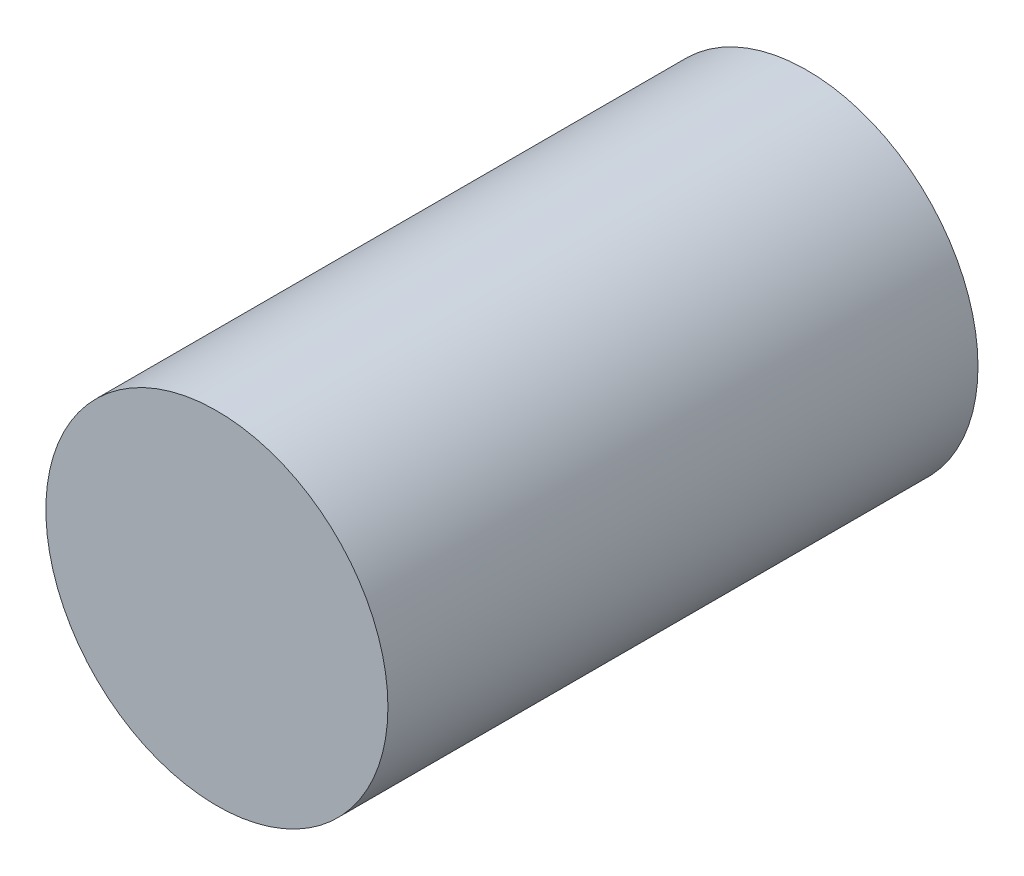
ISO-10303-21;
HEADER;
FILE_DESCRIPTION(('STEP AP214'),'2;1');
FILE_NAME('part.step','',(''),(''),'','','');
FILE_SCHEMA(('AUTOMOTIVE_DESIGN { 1 0 10303 214 1 1 1 1 }'));
ENDSEC;
DATA;
#1=APPLICATION_CONTEXT('core data for automotive mechanical design processes');
#2=APPLICATION_PROTOCOL_DEFINITION('international standard','automotive_design',2000,#1);
#3=PRODUCT_CONTEXT('',#1,'mechanical');
#4=PRODUCT('Part','Part','',(#3));
#5=PRODUCT_RELATED_PRODUCT_CATEGORY('part','',(#4));
#6=PRODUCT_DEFINITION_FORMATION('','',#4);
#7=PRODUCT_DEFINITION_CONTEXT('part definition',#1,'design');
#8=PRODUCT_DEFINITION('design','',#6,#7);
#9=PRODUCT_DEFINITION_SHAPE('','',#8);
#10=(LENGTH_UNIT() NAMED_UNIT(*) SI_UNIT(.MILLI.,.METRE.));
#11=(NAMED_UNIT(*) PLANE_ANGLE_UNIT() SI_UNIT($,.RADIAN.));
#12=(NAMED_UNIT(*) SI_UNIT($,.STERADIAN.) SOLID_ANGLE_UNIT());
#13=UNCERTAINTY_MEASURE_WITH_UNIT(LENGTH_MEASURE(1.E-05),#10,'distance_accuracy_value','');
#14=(GEOMETRIC_REPRESENTATION_CONTEXT(3) GLOBAL_UNCERTAINTY_ASSIGNED_CONTEXT((#13)) GLOBAL_UNIT_ASSIGNED_CONTEXT((#10,
#11,#12)) REPRESENTATION_CONTEXT('',''));
#15=CARTESIAN_POINT('',(0.,0.,0.));
#16=DIRECTION('',(0.,0.,1.));
#17=DIRECTION('',(1.,0.,0.));
#18=AXIS2_PLACEMENT_3D('',#15,#16,#17);
#19=CARTESIAN_POINT('',(0.,0.,-69.));
#20=DIRECTION('',(0.,0.,1.));
#21=DIRECTION('',(1.,0.,0.));
#22=AXIS2_PLACEMENT_3D('',#19,#20,#21);
#23=CYLINDRICAL_SURFACE('',#22,20.);
#24=CARTESIAN_POINT('',(0.,0.,-69.));
#25=DIRECTION('',(0.,0.,1.));
#26=DIRECTION('',(1.,0.,0.));
#27=AXIS2_PLACEMENT_3D('',#24,#25,#26);
#28=CIRCLE('',#27,20.);
#29=CARTESIAN_POINT('',(20.,0.,-69.));
#30=VERTEX_POINT('',#29);
#31=EDGE_CURVE('E10',#30,#30,#28,.T.);
#32=ORIENTED_EDGE('',*,*,#31,.T.);
#33=EDGE_LOOP('',(#32));
#34=FACE_BOUND('',#33,.T.);
#35=CARTESIAN_POINT('',(0.,0.,0.));
#36=DIRECTION('',(0.,0.,1.));
#37=DIRECTION('',(1.,0.,0.));
#38=AXIS2_PLACEMENT_3D('',#35,#36,#37);
#39=CIRCLE('',#38,20.);
#40=CARTESIAN_POINT('',(20.,0.,0.));
#41=VERTEX_POINT('',#40);
#42=EDGE_CURVE('E31',#41,#41,#39,.T.);
#43=ORIENTED_EDGE('',*,*,#42,.F.);
#44=EDGE_LOOP('',(#43));
#45=FACE_BOUND('',#44,.T.);
#46=ADVANCED_FACE('F28',(#34,#45),#23,.T.);
#47=CARTESIAN_POINT('',(0.,0.,-69.));
#48=DIRECTION('',(0.,0.,1.));
#49=DIRECTION('',(1.,0.,0.));
#50=AXIS2_PLACEMENT_3D('',#47,#48,#49);
#51=PLANE('',#50);
#52=ORIENTED_EDGE('',*,*,#31,.F.);
#53=EDGE_LOOP('',(#52));
#54=FACE_BOUND('',#53,.T.);
#55=ADVANCED_FACE('F43',(#54),#51,.F.);
#56=CARTESIAN_POINT('',(0.,0.,0.));
#57=DIRECTION('',(0.,0.,1.));
#58=DIRECTION('',(1.,0.,0.));
#59=AXIS2_PLACEMENT_3D('',#56,#57,#58);
#60=PLANE('',#59);
#61=ORIENTED_EDGE('',*,*,#42,.T.);
#62=EDGE_LOOP('',(#61));
#63=FACE_BOUND('',#62,.T.);
#64=ADVANCED_FACE('F40',(#63),#60,.T.);
#65=CLOSED_SHELL('',(#46,#55,#64));
#66=MANIFOLD_SOLID_BREP('B2',#65);
#67=ADVANCED_BREP_SHAPE_REPRESENTATION('',(#18,#66),#14);
#68=SHAPE_DEFINITION_REPRESENTATION(#9,#67);
ENDSEC;
END-ISO-10303-21;
